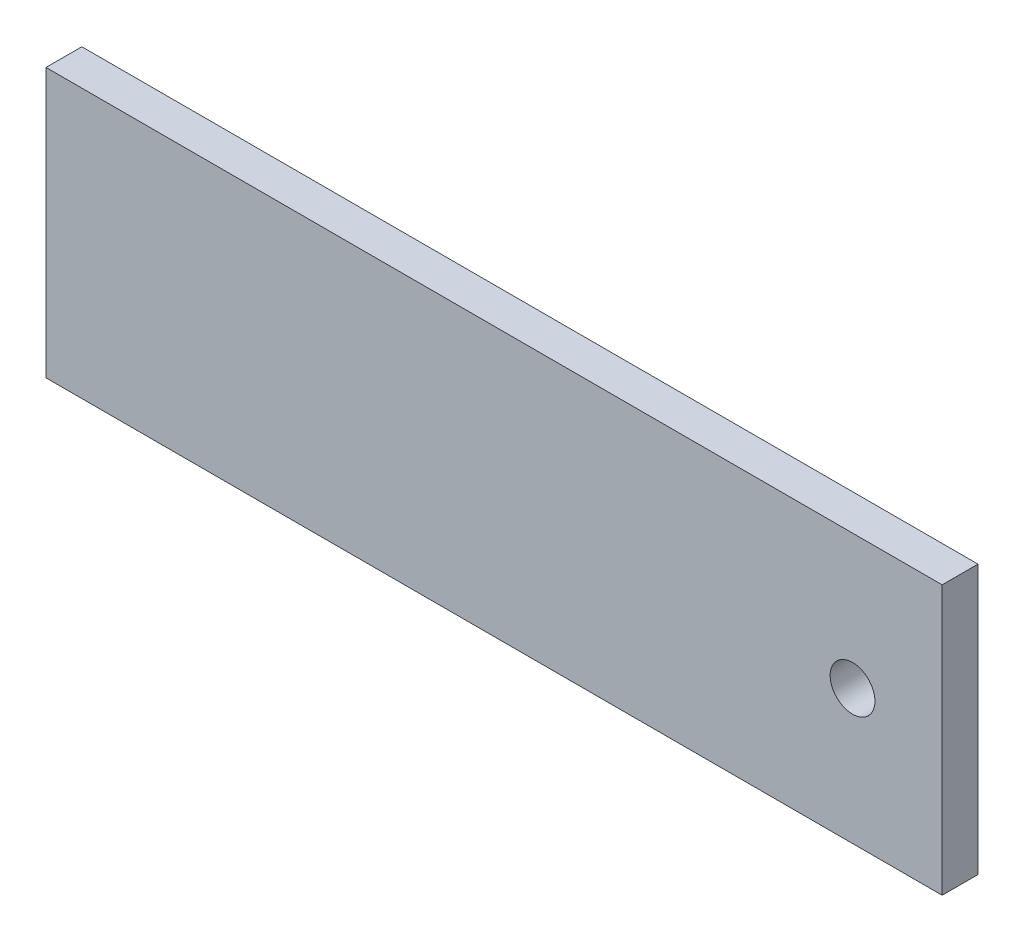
from build123d import *

# Parameters (mm, degrees)
ESQUISSE1_W       = 100
ESQUISSE1_H       = 30
EXTRUSION1_DEPTH  = 2
TROU_TARAUD_M61_D = 5


with BuildPart() as part:
    # Esquisse1 → Extrusion1 (new, symmetric)
    with BuildSketch(Plane.XY):
        with Locations((50, -15)):
            Rectangle(ESQUISSE1_W, ESQUISSE1_H)
    extrude(amount=EXTRUSION1_DEPTH, both=True)

    # Trou taraud_ M61 (through all)
    with Locations(Plane.XY.offset(2)):
        with Locations((90, -15)):
            Hole(TROU_TARAUD_M61_D / 2)


solid = part.part
